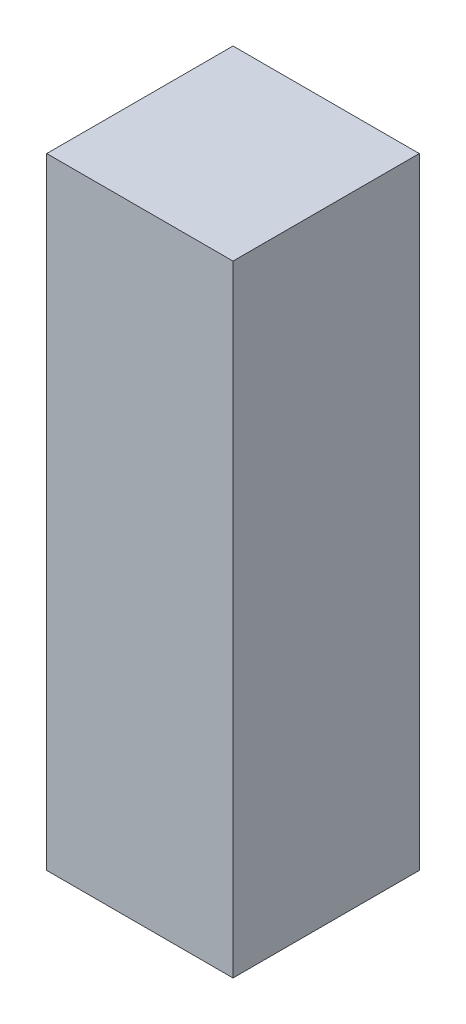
ISO-10303-21;
HEADER;
FILE_DESCRIPTION(('STEP AP214'),'2;1');
FILE_NAME('part.step','',(''),(''),'','','');
FILE_SCHEMA(('AUTOMOTIVE_DESIGN { 1 0 10303 214 1 1 1 1 }'));
ENDSEC;
DATA;
#1=APPLICATION_CONTEXT('core data for automotive mechanical design processes');
#2=APPLICATION_PROTOCOL_DEFINITION('international standard','automotive_design',2000,#1);
#3=PRODUCT_CONTEXT('',#1,'mechanical');
#4=PRODUCT('Part','Part','',(#3));
#5=PRODUCT_RELATED_PRODUCT_CATEGORY('part','',(#4));
#6=PRODUCT_DEFINITION_FORMATION('','',#4);
#7=PRODUCT_DEFINITION_CONTEXT('part definition',#1,'design');
#8=PRODUCT_DEFINITION('design','',#6,#7);
#9=PRODUCT_DEFINITION_SHAPE('','',#8);
#10=(LENGTH_UNIT() NAMED_UNIT(*) SI_UNIT(.MILLI.,.METRE.));
#11=(NAMED_UNIT(*) PLANE_ANGLE_UNIT() SI_UNIT($,.RADIAN.));
#12=(NAMED_UNIT(*) SI_UNIT($,.STERADIAN.) SOLID_ANGLE_UNIT());
#13=UNCERTAINTY_MEASURE_WITH_UNIT(LENGTH_MEASURE(1.E-05),#10,'distance_accuracy_value','');
#14=(GEOMETRIC_REPRESENTATION_CONTEXT(3) GLOBAL_UNCERTAINTY_ASSIGNED_CONTEXT((#13)) GLOBAL_UNIT_ASSIGNED_CONTEXT((#10,
#11,#12)) REPRESENTATION_CONTEXT('',''));
#15=CARTESIAN_POINT('',(0.,0.,0.));
#16=DIRECTION('',(0.,0.,1.));
#17=DIRECTION('',(1.,0.,0.));
#18=AXIS2_PLACEMENT_3D('',#15,#16,#17);
#19=CARTESIAN_POINT('',(-0.6,-0.6,1.305));
#20=DIRECTION('',(1.,0.,0.));
#21=DIRECTION('',(0.,0.,-1.));
#22=AXIS2_PLACEMENT_3D('',#19,#20,#21);
#23=PLANE('',#22);
#24=DIRECTION('',(0.,1.,0.));
#25=VECTOR('',#24,1.);
#26=CARTESIAN_POINT('',(-0.6,-0.6,1.605));
#27=LINE('',#26,#25);
#28=CARTESIAN_POINT('',(-0.6,-0.6,1.605));
#29=VERTEX_POINT('',#28);
#30=CARTESIAN_POINT('',(-0.6,0.4,1.605));
#31=VERTEX_POINT('',#30);
#32=EDGE_CURVE('E11',#29,#31,#27,.T.);
#33=ORIENTED_EDGE('',*,*,#32,.F.);
#34=DIRECTION('',(0.,0.,1.));
#35=VECTOR('',#34,1.);
#36=CARTESIAN_POINT('',(-0.6,-0.6,1.305));
#37=LINE('',#36,#35);
#38=CARTESIAN_POINT('',(-0.6,-0.6,1.305));
#39=VERTEX_POINT('',#38);
#40=EDGE_CURVE('E25',#39,#29,#37,.T.);
#41=ORIENTED_EDGE('',*,*,#40,.F.);
#42=DIRECTION('',(0.,1.,0.));
#43=VECTOR('',#42,1.);
#44=CARTESIAN_POINT('',(-0.6,-0.6,1.305));
#45=LINE('',#44,#43);
#46=CARTESIAN_POINT('',(-0.6,0.4,1.305));
#47=VERTEX_POINT('',#46);
#48=EDGE_CURVE('E94',#39,#47,#45,.T.);
#49=ORIENTED_EDGE('',*,*,#48,.T.);
#50=DIRECTION('',(0.,0.,1.));
#51=VECTOR('',#50,1.);
#52=CARTESIAN_POINT('',(-0.6,0.4,1.305));
#53=LINE('',#52,#51);
#54=EDGE_CURVE('E90',#47,#31,#53,.T.);
#55=ORIENTED_EDGE('',*,*,#54,.T.);
#56=EDGE_LOOP('',(#33,#41,#49,#55));
#57=FACE_BOUND('',#56,.T.);
#58=ADVANCED_FACE('F17',(#57),#23,.T.);
#59=CARTESIAN_POINT('',(-0.6,0.4,1.305));
#60=DIRECTION('',(0.,1.,0.));
#61=DIRECTION('',(0.,0.,1.));
#62=AXIS2_PLACEMENT_3D('',#59,#60,#61);
#63=PLANE('',#62);
#64=DIRECTION('',(-1.,0.,0.));
#65=VECTOR('',#64,1.);
#66=CARTESIAN_POINT('',(-0.6,0.4,1.605));
#67=LINE('',#66,#65);
#68=CARTESIAN_POINT('',(-0.9,0.4,1.605));
#69=VERTEX_POINT('',#68);
#70=EDGE_CURVE('E73',#31,#69,#67,.T.);
#71=ORIENTED_EDGE('',*,*,#70,.F.);
#72=ORIENTED_EDGE('',*,*,#54,.F.);
#73=DIRECTION('',(-1.,0.,0.));
#74=VECTOR('',#73,1.);
#75=CARTESIAN_POINT('',(-0.6,0.4,1.305));
#76=LINE('',#75,#74);
#77=CARTESIAN_POINT('',(-0.9,0.4,1.305));
#78=VERTEX_POINT('',#77);
#79=EDGE_CURVE('E76',#47,#78,#76,.T.);
#80=ORIENTED_EDGE('',*,*,#79,.T.);
#81=DIRECTION('',(0.,0.,1.));
#82=VECTOR('',#81,1.);
#83=CARTESIAN_POINT('',(-0.9,0.4,1.305));
#84=LINE('',#83,#82);
#85=EDGE_CURVE('E74',#78,#69,#84,.T.);
#86=ORIENTED_EDGE('',*,*,#85,.T.);
#87=EDGE_LOOP('',(#71,#72,#80,#86));
#88=FACE_BOUND('',#87,.T.);
#89=ADVANCED_FACE('F108',(#88),#63,.T.);
#90=CARTESIAN_POINT('',(-0.9,-0.6,1.305));
#91=DIRECTION('',(-1.,0.,0.));
#92=DIRECTION('',(0.,0.,1.));
#93=AXIS2_PLACEMENT_3D('',#90,#91,#92);
#94=PLANE('',#93);
#95=DIRECTION('',(0.,-1.,0.));
#96=VECTOR('',#95,1.);
#97=CARTESIAN_POINT('',(-0.9,-0.6,1.605));
#98=LINE('',#97,#96);
#99=CARTESIAN_POINT('',(-0.9,-0.6,1.605));
#100=VERTEX_POINT('',#99);
#101=EDGE_CURVE('E59',#69,#100,#98,.T.);
#102=ORIENTED_EDGE('',*,*,#101,.F.);
#103=ORIENTED_EDGE('',*,*,#85,.F.);
#104=DIRECTION('',(0.,-1.,0.));
#105=VECTOR('',#104,1.);
#106=CARTESIAN_POINT('',(-0.9,-0.6,1.305));
#107=LINE('',#106,#105);
#108=CARTESIAN_POINT('',(-0.9,-0.6,1.305));
#109=VERTEX_POINT('',#108);
#110=EDGE_CURVE('E62',#78,#109,#107,.T.);
#111=ORIENTED_EDGE('',*,*,#110,.T.);
#112=DIRECTION('',(0.,0.,1.));
#113=VECTOR('',#112,1.);
#114=CARTESIAN_POINT('',(-0.9,-0.6,1.305));
#115=LINE('',#114,#113);
#116=EDGE_CURVE('E54',#109,#100,#115,.T.);
#117=ORIENTED_EDGE('',*,*,#116,.T.);
#118=EDGE_LOOP('',(#102,#103,#111,#117));
#119=FACE_BOUND('',#118,.T.);
#120=ADVANCED_FACE('F56',(#119),#94,.T.);
#121=CARTESIAN_POINT('',(-0.6,-0.6,1.305));
#122=DIRECTION('',(0.,-1.,0.));
#123=DIRECTION('',(0.,0.,-1.));
#124=AXIS2_PLACEMENT_3D('',#121,#122,#123);
#125=PLANE('',#124);
#126=DIRECTION('',(1.,0.,0.));
#127=VECTOR('',#126,1.);
#128=CARTESIAN_POINT('',(-0.6,-0.6,1.605));
#129=LINE('',#128,#127);
#130=EDGE_CURVE('E65',#100,#29,#129,.T.);
#131=ORIENTED_EDGE('',*,*,#130,.F.);
#132=ORIENTED_EDGE('',*,*,#116,.F.);
#133=DIRECTION('',(1.,0.,0.));
#134=VECTOR('',#133,1.);
#135=CARTESIAN_POINT('',(-0.6,-0.6,1.305));
#136=LINE('',#135,#134);
#137=EDGE_CURVE('E69',#109,#39,#136,.T.);
#138=ORIENTED_EDGE('',*,*,#137,.T.);
#139=ORIENTED_EDGE('',*,*,#40,.T.);
#140=EDGE_LOOP('',(#131,#132,#138,#139));
#141=FACE_BOUND('',#140,.T.);
#142=ADVANCED_FACE('F67',(#141),#125,.T.);
#143=CARTESIAN_POINT('',(0.,0.,1.305));
#144=DIRECTION('',(0.,0.,1.));
#145=DIRECTION('',(1.,0.,0.));
#146=AXIS2_PLACEMENT_3D('',#143,#144,#145);
#147=PLANE('',#146);
#148=ORIENTED_EDGE('',*,*,#48,.F.);
#149=ORIENTED_EDGE('',*,*,#137,.F.);
#150=ORIENTED_EDGE('',*,*,#110,.F.);
#151=ORIENTED_EDGE('',*,*,#79,.F.);
#152=EDGE_LOOP('',(#148,#149,#150,#151));
#153=FACE_BOUND('',#152,.T.);
#154=ADVANCED_FACE('F106',(#153),#147,.F.);
#155=CARTESIAN_POINT('',(0.,0.,1.605));
#156=DIRECTION('',(0.,0.,1.));
#157=DIRECTION('',(1.,0.,0.));
#158=AXIS2_PLACEMENT_3D('',#155,#156,#157);
#159=PLANE('',#158);
#160=ORIENTED_EDGE('',*,*,#32,.T.);
#161=ORIENTED_EDGE('',*,*,#70,.T.);
#162=ORIENTED_EDGE('',*,*,#101,.T.);
#163=ORIENTED_EDGE('',*,*,#130,.T.);
#164=EDGE_LOOP('',(#160,#161,#162,#163));
#165=FACE_BOUND('',#164,.T.);
#166=ADVANCED_FACE('F71',(#165),#159,.T.);
#167=CLOSED_SHELL('',(#58,#89,#120,#142,#154,#166));
#168=MANIFOLD_SOLID_BREP('B1',#167);
#169=ADVANCED_BREP_SHAPE_REPRESENTATION('',(#18,#168),#14);
#170=SHAPE_DEFINITION_REPRESENTATION(#9,#169);
ENDSEC;
END-ISO-10303-21;
